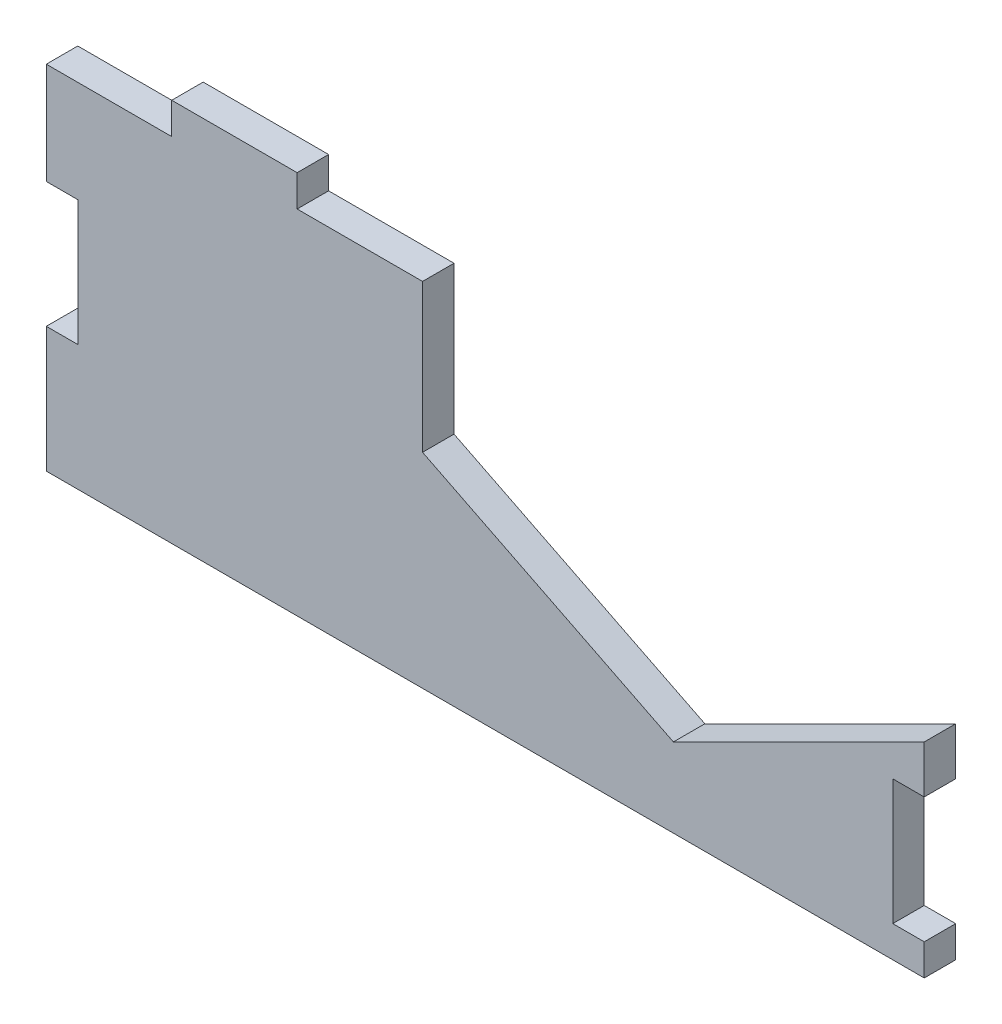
from build123d import *

# Parameters (mm, degrees)
BOSS_EXTRUDE1_DEPTH = 19


with BuildPart() as part:
    # Sketch1 → Boss-Extrude1 (new body)
    with BuildSketch(Plane.XY):
        Polygon((89.064345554, 353.134265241), (-62.364224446, 277.419979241), (-213.792796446, 353.134265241), (-213.792796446, 442.477122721), (-289.507082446, 442.477122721), (-289.507082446, 461.477122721), (-365.221368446, 461.477122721), (-365.221368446, 442.477122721), (-440.935654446, 442.477122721), (-440.935654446, 381.148551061), (-421.935654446, 381.148551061), (-421.935654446, 305.434265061), (-440.935654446, 305.434265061), (-440.935654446, 229.719979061), (89.064345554, 229.719979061), (89.064345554, 248.648550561), (70.064345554, 248.648550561), (70.064345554, 324.362836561), (89.064345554, 324.362836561), align=None)
    extrude(amount=BOSS_EXTRUDE1_DEPTH)


solid = part.part
